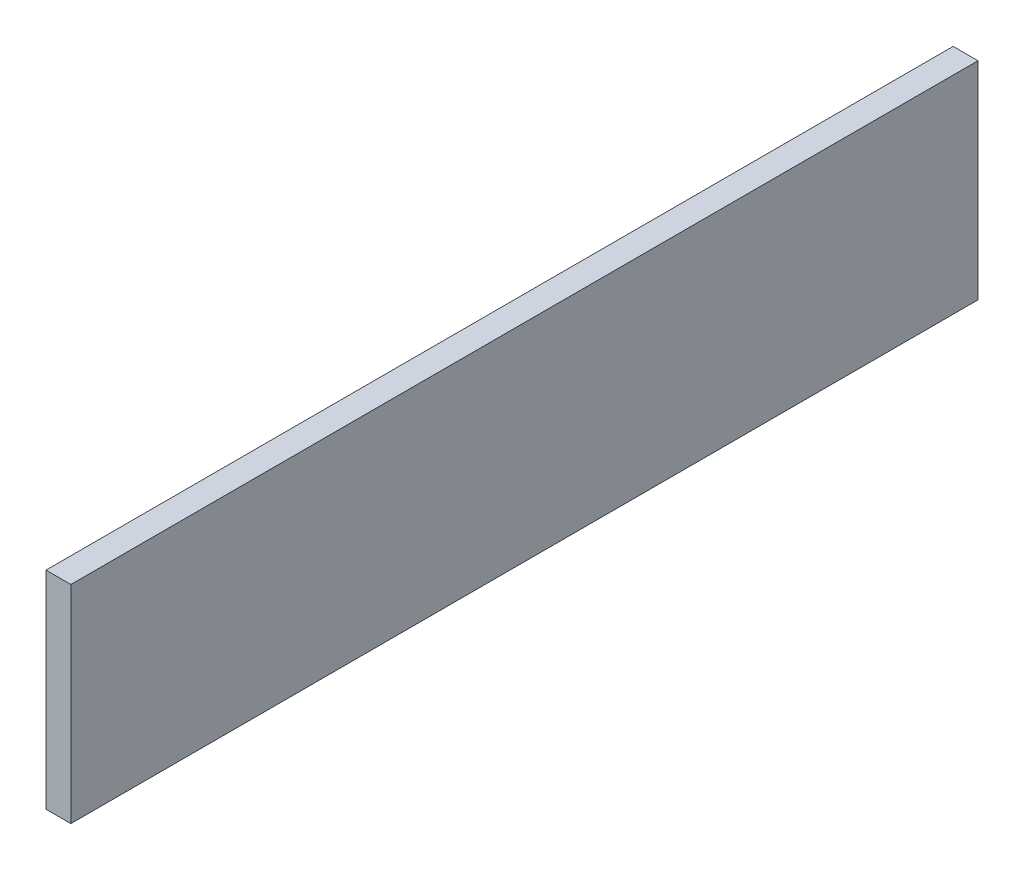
from build123d import *

# Parameters (mm, degrees)
SKETCH1_W           = 111.252
SKETCH1_H           = 25.4
BOSS_EXTRUDE1_DEPTH = 3.048


with BuildPart() as part:
    # Sketch1 → Boss-Extrude1 (new body)
    with BuildSketch(Plane(origin=(0, 0, 0), x_dir=(0, 0, -1), z_dir=(1, 0, 0))):
        with Locations((55.626, 12.7)):
            Rectangle(SKETCH1_W, SKETCH1_H)
    extrude(amount=BOSS_EXTRUDE1_DEPTH)


solid = part.part
